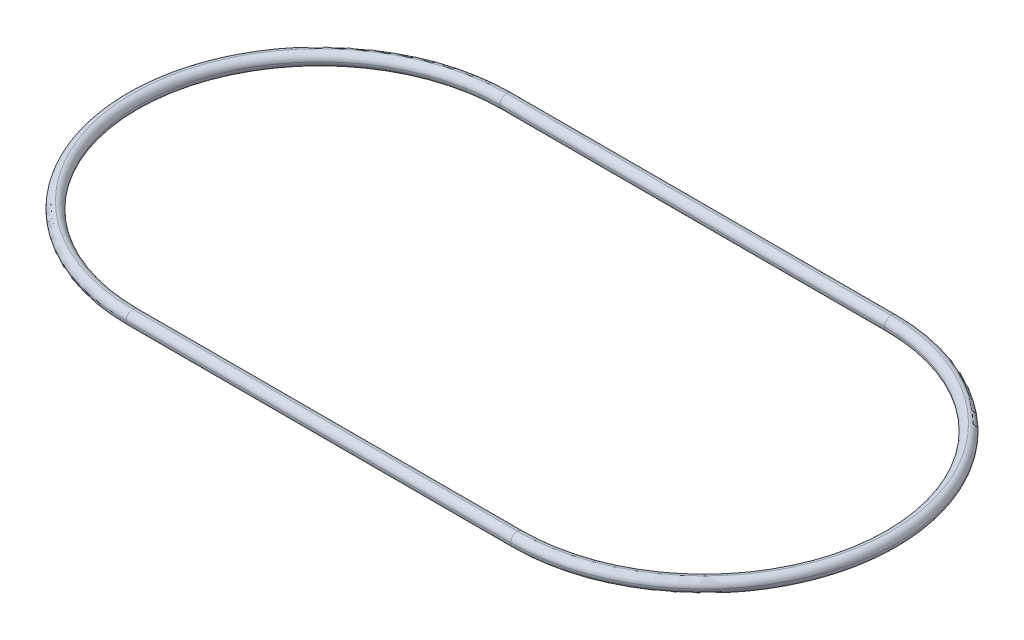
ISO-10303-21;
HEADER;
FILE_DESCRIPTION(('STEP AP214'),'2;1');
FILE_NAME('part.step','',(''),(''),'','','');
FILE_SCHEMA(('AUTOMOTIVE_DESIGN { 1 0 10303 214 1 1 1 1 }'));
ENDSEC;
DATA;
#1=APPLICATION_CONTEXT('core data for automotive mechanical design processes');
#2=APPLICATION_PROTOCOL_DEFINITION('international standard','automotive_design',2000,#1);
#3=PRODUCT_CONTEXT('',#1,'mechanical');
#4=PRODUCT('Part','Part','',(#3));
#5=PRODUCT_RELATED_PRODUCT_CATEGORY('part','',(#4));
#6=PRODUCT_DEFINITION_FORMATION('','',#4);
#7=PRODUCT_DEFINITION_CONTEXT('part definition',#1,'design');
#8=PRODUCT_DEFINITION('design','',#6,#7);
#9=PRODUCT_DEFINITION_SHAPE('','',#8);
#10=(LENGTH_UNIT() NAMED_UNIT(*) SI_UNIT(.MILLI.,.METRE.));
#11=(NAMED_UNIT(*) PLANE_ANGLE_UNIT() SI_UNIT($,.RADIAN.));
#12=(NAMED_UNIT(*) SI_UNIT($,.STERADIAN.) SOLID_ANGLE_UNIT());
#13=UNCERTAINTY_MEASURE_WITH_UNIT(LENGTH_MEASURE(1.E-05),#10,'distance_accuracy_value','');
#14=(GEOMETRIC_REPRESENTATION_CONTEXT(3) GLOBAL_UNCERTAINTY_ASSIGNED_CONTEXT((#13)) GLOBAL_UNIT_ASSIGNED_CONTEXT((#10,
#11,#12)) REPRESENTATION_CONTEXT('',''));
#15=CARTESIAN_POINT('',(0.,0.,0.));
#16=DIRECTION('',(0.,0.,1.));
#17=DIRECTION('',(1.,0.,0.));
#18=AXIS2_PLACEMENT_3D('',#15,#16,#17);
#19=CARTESIAN_POINT('',(0.,2.5,70.));
#20=DIRECTION('',(-1.,0.,0.));
#21=DIRECTION('',(0.,0.,1.));
#22=AXIS2_PLACEMENT_3D('',#19,#20,#21);
#23=CYLINDRICAL_SURFACE('',#22,2.5);
#24=CARTESIAN_POINT('',(144.,2.5,70.));
#25=DIRECTION('',(1.,0.,0.));
#26=DIRECTION('',(0.,0.,-1.));
#27=AXIS2_PLACEMENT_3D('',#24,#25,#26);
#28=CIRCLE('',#27,2.5);
#29=CARTESIAN_POINT('',(144.,5.,70.));
#30=VERTEX_POINT('',#29);
#31=CARTESIAN_POINT('',(144.,2.5,72.5));
#32=VERTEX_POINT('',#31);
#33=EDGE_CURVE('E11',#30,#32,#28,.T.);
#34=ORIENTED_EDGE('',*,*,#33,.F.);
#35=DIRECTION('',(1.,0.,0.));
#36=VECTOR('',#35,1.);
#37=CARTESIAN_POINT('',(144.,5.,70.));
#38=LINE('',#37,#36);
#39=CARTESIAN_POINT('',(0.,5.,70.));
#40=VERTEX_POINT('',#39);
#41=EDGE_CURVE('E185',#40,#30,#38,.T.);
#42=ORIENTED_EDGE('',*,*,#41,.F.);
#43=CARTESIAN_POINT('',(0.,2.5,70.));
#44=DIRECTION('',(-1.,0.,0.));
#45=DIRECTION('',(0.,0.,1.));
#46=AXIS2_PLACEMENT_3D('',#43,#44,#45);
#47=CIRCLE('',#46,2.5);
#48=CARTESIAN_POINT('',(0.,2.5,72.5));
#49=VERTEX_POINT('',#48);
#50=EDGE_CURVE('E182',#49,#40,#47,.T.);
#51=ORIENTED_EDGE('',*,*,#50,.F.);
#52=DIRECTION('',(1.,0.,0.));
#53=VECTOR('',#52,1.);
#54=CARTESIAN_POINT('',(0.,2.5,72.5));
#55=LINE('',#54,#53);
#56=EDGE_CURVE('E34',#32,#49,#55,.F.);
#57=ORIENTED_EDGE('',*,*,#56,.F.);
#58=EDGE_LOOP('',(#34,#42,#51,#57));
#59=FACE_BOUND('',#58,.T.);
#60=ADVANCED_FACE('F27',(#59),#23,.T.);
#61=CARTESIAN_POINT('',(144.,2.5,0.));
#62=DIRECTION('',(0.,1.,0.));
#63=DIRECTION('',(0.,0.,1.));
#64=AXIS2_PLACEMENT_3D('',#61,#62,#63);
#65=TOROIDAL_SURFACE('',#64,70.,2.5);
#66=CARTESIAN_POINT('',(144.,5.,0.));
#67=DIRECTION('',(0.,1.,0.));
#68=DIRECTION('',(0.,0.,1.));
#69=AXIS2_PLACEMENT_3D('',#66,#67,#68);
#70=CIRCLE('',#69,70.);
#71=CARTESIAN_POINT('',(144.,5.,-70.));
#72=VERTEX_POINT('',#71);
#73=EDGE_CURVE('E180',#30,#72,#70,.T.);
#74=ORIENTED_EDGE('',*,*,#73,.F.);
#75=ORIENTED_EDGE('',*,*,#33,.T.);
#76=CARTESIAN_POINT('',(144.,2.5,0.));
#77=DIRECTION('',(0.,1.,0.));
#78=DIRECTION('',(0.,0.,1.));
#79=AXIS2_PLACEMENT_3D('',#76,#77,#78);
#80=CIRCLE('',#79,72.5);
#81=CARTESIAN_POINT('',(144.,2.5,-72.5));
#82=VERTEX_POINT('',#81);
#83=EDGE_CURVE('E172',#82,#32,#80,.F.);
#84=ORIENTED_EDGE('',*,*,#83,.F.);
#85=CARTESIAN_POINT('',(144.,2.5,-70.));
#86=DIRECTION('',(-1.,0.,0.));
#87=DIRECTION('',(0.,0.,1.));
#88=AXIS2_PLACEMENT_3D('',#85,#86,#87);
#89=CIRCLE('',#88,2.5);
#90=EDGE_CURVE('E169',#72,#82,#89,.T.);
#91=ORIENTED_EDGE('',*,*,#90,.F.);
#92=EDGE_LOOP('',(#74,#75,#84,#91));
#93=FACE_BOUND('',#92,.T.);
#94=ADVANCED_FACE('F217',(#93),#65,.T.);
#95=CARTESIAN_POINT('',(144.,2.5,70.));
#96=DIRECTION('',(1.,0.,0.));
#97=DIRECTION('',(0.,0.,-1.));
#98=AXIS2_PLACEMENT_3D('',#95,#96,#97);
#99=CYLINDRICAL_SURFACE('',#98,2.5);
#100=CARTESIAN_POINT('',(144.,2.5,70.));
#101=DIRECTION('',(1.,0.,0.));
#102=DIRECTION('',(0.,0.,-1.));
#103=AXIS2_PLACEMENT_3D('',#100,#101,#102);
#104=CIRCLE('',#103,2.5);
#105=CARTESIAN_POINT('',(144.,0.,70.));
#106=VERTEX_POINT('',#105);
#107=EDGE_CURVE('E175',#32,#106,#104,.T.);
#108=ORIENTED_EDGE('',*,*,#107,.F.);
#109=ORIENTED_EDGE('',*,*,#56,.T.);
#110=CARTESIAN_POINT('',(0.,2.5,70.));
#111=DIRECTION('',(-1.,0.,0.));
#112=DIRECTION('',(0.,0.,1.));
#113=AXIS2_PLACEMENT_3D('',#110,#111,#112);
#114=CIRCLE('',#113,2.5);
#115=CARTESIAN_POINT('',(0.,0.,70.));
#116=VERTEX_POINT('',#115);
#117=EDGE_CURVE('E164',#116,#49,#114,.T.);
#118=ORIENTED_EDGE('',*,*,#117,.F.);
#119=DIRECTION('',(1.,0.,0.));
#120=VECTOR('',#119,1.);
#121=CARTESIAN_POINT('',(0.,0.,70.));
#122=LINE('',#121,#120);
#123=EDGE_CURVE('E161',#106,#116,#122,.F.);
#124=ORIENTED_EDGE('',*,*,#123,.F.);
#125=EDGE_LOOP('',(#108,#109,#118,#124));
#126=FACE_BOUND('',#125,.T.);
#127=ADVANCED_FACE('F189',(#126),#99,.T.);
#128=CARTESIAN_POINT('',(0.,2.5,70.));
#129=DIRECTION('',(1.,0.,0.));
#130=DIRECTION('',(0.,0.,-1.));
#131=AXIS2_PLACEMENT_3D('',#128,#129,#130);
#132=CYLINDRICAL_SURFACE('',#131,2.5);
#133=CARTESIAN_POINT('',(0.,2.5,70.));
#134=DIRECTION('',(-1.,0.,0.));
#135=DIRECTION('',(0.,0.,1.));
#136=AXIS2_PLACEMENT_3D('',#133,#134,#135);
#137=CIRCLE('',#136,2.5);
#138=CARTESIAN_POINT('',(0.,2.5,67.5));
#139=VERTEX_POINT('',#138);
#140=EDGE_CURVE('E155',#40,#139,#137,.T.);
#141=ORIENTED_EDGE('',*,*,#140,.F.);
#142=ORIENTED_EDGE('',*,*,#41,.T.);
#143=CARTESIAN_POINT('',(144.,2.5,70.));
#144=DIRECTION('',(1.,0.,0.));
#145=DIRECTION('',(0.,0.,-1.));
#146=AXIS2_PLACEMENT_3D('',#143,#144,#145);
#147=CIRCLE('',#146,2.5);
#148=CARTESIAN_POINT('',(144.,2.5,67.5));
#149=VERTEX_POINT('',#148);
#150=EDGE_CURVE('E177',#149,#30,#147,.T.);
#151=ORIENTED_EDGE('',*,*,#150,.F.);
#152=DIRECTION('',(1.,0.,0.));
#153=VECTOR('',#152,1.);
#154=CARTESIAN_POINT('',(0.,2.5,67.5));
#155=LINE('',#154,#153);
#156=EDGE_CURVE('E158',#139,#149,#155,.T.);
#157=ORIENTED_EDGE('',*,*,#156,.F.);
#158=EDGE_LOOP('',(#141,#142,#151,#157));
#159=FACE_BOUND('',#158,.T.);
#160=ADVANCED_FACE('F215',(#159),#132,.T.);
#161=CARTESIAN_POINT('',(0.,2.5,0.));
#162=DIRECTION('',(0.,1.,0.));
#163=DIRECTION('',(0.,0.,1.));
#164=AXIS2_PLACEMENT_3D('',#161,#162,#163);
#165=TOROIDAL_SURFACE('',#164,70.,2.5);
#166=CARTESIAN_POINT('',(0.,2.5,0.));
#167=DIRECTION('',(0.,1.,0.));
#168=DIRECTION('',(0.,0.,1.));
#169=AXIS2_PLACEMENT_3D('',#166,#167,#168);
#170=CIRCLE('',#169,72.5);
#171=CARTESIAN_POINT('',(0.,2.5,-72.5));
#172=VERTEX_POINT('',#171);
#173=EDGE_CURVE('E95',#49,#172,#170,.F.);
#174=ORIENTED_EDGE('',*,*,#173,.F.);
#175=ORIENTED_EDGE('',*,*,#50,.T.);
#176=CARTESIAN_POINT('',(0.,5.,0.));
#177=DIRECTION('',(0.,1.,0.));
#178=DIRECTION('',(0.,0.,1.));
#179=AXIS2_PLACEMENT_3D('',#176,#177,#178);
#180=CIRCLE('',#179,70.);
#181=CARTESIAN_POINT('',(0.,5.,-70.));
#182=VERTEX_POINT('',#181);
#183=EDGE_CURVE('E152',#182,#40,#180,.T.);
#184=ORIENTED_EDGE('',*,*,#183,.F.);
#185=CARTESIAN_POINT('',(0.,2.5,-70.));
#186=DIRECTION('',(1.,0.,0.));
#187=DIRECTION('',(0.,1.,0.));
#188=AXIS2_PLACEMENT_3D('',#185,#186,#187);
#189=CIRCLE('',#188,2.5);
#190=EDGE_CURVE('E167',#172,#182,#189,.T.);
#191=ORIENTED_EDGE('',*,*,#190,.F.);
#192=EDGE_LOOP('',(#174,#175,#184,#191));
#193=FACE_BOUND('',#192,.T.);
#194=ADVANCED_FACE('F194',(#193),#165,.T.);
#195=CARTESIAN_POINT('',(144.,2.5,0.));
#196=DIRECTION('',(0.,1.,0.));
#197=DIRECTION('',(0.,0.,1.));
#198=AXIS2_PLACEMENT_3D('',#195,#196,#197);
#199=TOROIDAL_SURFACE('',#198,70.,2.5);
#200=ORIENTED_EDGE('',*,*,#150,.T.);
#201=ORIENTED_EDGE('',*,*,#73,.T.);
#202=CARTESIAN_POINT('',(144.,2.5,-70.));
#203=DIRECTION('',(-1.,0.,0.));
#204=DIRECTION('',(0.,0.,1.));
#205=AXIS2_PLACEMENT_3D('',#202,#203,#204);
#206=CIRCLE('',#205,2.5);
#207=CARTESIAN_POINT('',(144.,2.5,-67.5));
#208=VERTEX_POINT('',#207);
#209=EDGE_CURVE('E144',#208,#72,#206,.T.);
#210=ORIENTED_EDGE('',*,*,#209,.F.);
#211=CARTESIAN_POINT('',(144.,2.5,0.));
#212=DIRECTION('',(0.,1.,0.));
#213=DIRECTION('',(0.,0.,1.));
#214=AXIS2_PLACEMENT_3D('',#211,#212,#213);
#215=CIRCLE('',#214,67.5);
#216=EDGE_CURVE('E141',#149,#208,#215,.T.);
#217=ORIENTED_EDGE('',*,*,#216,.F.);
#218=EDGE_LOOP('',(#200,#201,#210,#217));
#219=FACE_BOUND('',#218,.T.);
#220=ADVANCED_FACE('F216',(#219),#199,.T.);
#221=CARTESIAN_POINT('',(144.,2.5,0.));
#222=DIRECTION('',(0.,1.,0.));
#223=DIRECTION('',(0.,0.,1.));
#224=AXIS2_PLACEMENT_3D('',#221,#222,#223);
#225=TOROIDAL_SURFACE('',#224,70.,2.5);
#226=ORIENTED_EDGE('',*,*,#83,.T.);
#227=ORIENTED_EDGE('',*,*,#107,.T.);
#228=CARTESIAN_POINT('',(144.,0.,0.));
#229=DIRECTION('',(0.,1.,0.));
#230=DIRECTION('',(0.,0.,1.));
#231=AXIS2_PLACEMENT_3D('',#228,#229,#230);
#232=CIRCLE('',#231,70.);
#233=CARTESIAN_POINT('',(144.,0.,-70.));
#234=VERTEX_POINT('',#233);
#235=EDGE_CURVE('E135',#234,#106,#232,.F.);
#236=ORIENTED_EDGE('',*,*,#235,.F.);
#237=CARTESIAN_POINT('',(144.,2.5,-70.));
#238=DIRECTION('',(-1.,0.,0.));
#239=DIRECTION('',(0.,0.,1.));
#240=AXIS2_PLACEMENT_3D('',#237,#238,#239);
#241=CIRCLE('',#240,2.5);
#242=EDGE_CURVE('E116',#82,#234,#241,.T.);
#243=ORIENTED_EDGE('',*,*,#242,.F.);
#244=EDGE_LOOP('',(#226,#227,#236,#243));
#245=FACE_BOUND('',#244,.T.);
#246=ADVANCED_FACE('F201',(#245),#225,.T.);
#247=CARTESIAN_POINT('',(0.,2.5,-70.));
#248=DIRECTION('',(1.,0.,0.));
#249=DIRECTION('',(0.,0.,-1.));
#250=AXIS2_PLACEMENT_3D('',#247,#248,#249);
#251=CYLINDRICAL_SURFACE('',#250,2.5);
#252=DIRECTION('',(-1.,0.,0.));
#253=VECTOR('',#252,1.);
#254=CARTESIAN_POINT('',(0.,5.,-70.));
#255=LINE('',#254,#253);
#256=EDGE_CURVE('E147',#72,#182,#255,.T.);
#257=ORIENTED_EDGE('',*,*,#256,.F.);
#258=ORIENTED_EDGE('',*,*,#90,.T.);
#259=DIRECTION('',(-1.,0.,0.));
#260=VECTOR('',#259,1.);
#261=CARTESIAN_POINT('',(144.,2.5,-72.5));
#262=LINE('',#261,#260);
#263=EDGE_CURVE('E100',#172,#82,#262,.F.);
#264=ORIENTED_EDGE('',*,*,#263,.F.);
#265=ORIENTED_EDGE('',*,*,#190,.T.);
#266=EDGE_LOOP('',(#257,#258,#264,#265));
#267=FACE_BOUND('',#266,.T.);
#268=ADVANCED_FACE('F198',(#267),#251,.T.);
#269=CARTESIAN_POINT('',(0.,2.5,0.));
#270=DIRECTION('',(0.,1.,0.));
#271=DIRECTION('',(0.,0.,1.));
#272=AXIS2_PLACEMENT_3D('',#269,#270,#271);
#273=TOROIDAL_SURFACE('',#272,70.,2.5);
#274=ORIENTED_EDGE('',*,*,#117,.T.);
#275=ORIENTED_EDGE('',*,*,#173,.T.);
#276=CARTESIAN_POINT('',(0.,2.5,-70.));
#277=DIRECTION('',(1.,0.,0.));
#278=DIRECTION('',(0.,0.,-1.));
#279=AXIS2_PLACEMENT_3D('',#276,#277,#278);
#280=CIRCLE('',#279,2.5);
#281=CARTESIAN_POINT('',(0.,0.,-70.));
#282=VERTEX_POINT('',#281);
#283=EDGE_CURVE('E88',#282,#172,#280,.T.);
#284=ORIENTED_EDGE('',*,*,#283,.F.);
#285=CARTESIAN_POINT('',(0.,0.,0.));
#286=DIRECTION('',(0.,1.,0.));
#287=DIRECTION('',(0.,0.,1.));
#288=AXIS2_PLACEMENT_3D('',#285,#286,#287);
#289=CIRCLE('',#288,70.);
#290=EDGE_CURVE('E92',#116,#282,#289,.F.);
#291=ORIENTED_EDGE('',*,*,#290,.F.);
#292=EDGE_LOOP('',(#274,#275,#284,#291));
#293=FACE_BOUND('',#292,.T.);
#294=ADVANCED_FACE('F91',(#293),#273,.T.);
#295=CARTESIAN_POINT('',(0.,2.5,70.));
#296=DIRECTION('',(-1.,0.,0.));
#297=DIRECTION('',(0.,0.,1.));
#298=AXIS2_PLACEMENT_3D('',#295,#296,#297);
#299=CYLINDRICAL_SURFACE('',#298,2.5);
#300=CARTESIAN_POINT('',(0.,2.5,70.));
#301=DIRECTION('',(-1.,0.,0.));
#302=DIRECTION('',(0.,0.,1.));
#303=AXIS2_PLACEMENT_3D('',#300,#301,#302);
#304=CIRCLE('',#303,2.5);
#305=EDGE_CURVE('E109',#139,#116,#304,.T.);
#306=ORIENTED_EDGE('',*,*,#305,.F.);
#307=ORIENTED_EDGE('',*,*,#156,.T.);
#308=CARTESIAN_POINT('',(144.,2.5,70.));
#309=DIRECTION('',(1.,0.,0.));
#310=DIRECTION('',(0.,0.,-1.));
#311=AXIS2_PLACEMENT_3D('',#308,#309,#310);
#312=CIRCLE('',#311,2.5);
#313=EDGE_CURVE('E138',#106,#149,#312,.T.);
#314=ORIENTED_EDGE('',*,*,#313,.F.);
#315=ORIENTED_EDGE('',*,*,#123,.T.);
#316=EDGE_LOOP('',(#306,#307,#314,#315));
#317=FACE_BOUND('',#316,.T.);
#318=ADVANCED_FACE('F214',(#317),#299,.T.);
#319=CARTESIAN_POINT('',(0.,2.5,0.));
#320=DIRECTION('',(0.,1.,0.));
#321=DIRECTION('',(0.,0.,1.));
#322=AXIS2_PLACEMENT_3D('',#319,#320,#321);
#323=TOROIDAL_SURFACE('',#322,70.,2.5);
#324=CARTESIAN_POINT('',(0.,2.5,-70.));
#325=DIRECTION('',(1.,0.,0.));
#326=DIRECTION('',(0.,0.,-1.));
#327=AXIS2_PLACEMENT_3D('',#324,#325,#326);
#328=CIRCLE('',#327,2.5);
#329=CARTESIAN_POINT('',(0.,2.5,-67.5));
#330=VERTEX_POINT('',#329);
#331=EDGE_CURVE('E150',#182,#330,#328,.T.);
#332=ORIENTED_EDGE('',*,*,#331,.F.);
#333=ORIENTED_EDGE('',*,*,#183,.T.);
#334=ORIENTED_EDGE('',*,*,#140,.T.);
#335=CARTESIAN_POINT('',(0.,2.5,0.));
#336=DIRECTION('',(0.,1.,0.));
#337=DIRECTION('',(0.,0.,1.));
#338=AXIS2_PLACEMENT_3D('',#335,#336,#337);
#339=CIRCLE('',#338,67.5);
#340=EDGE_CURVE('E130',#330,#139,#339,.T.);
#341=ORIENTED_EDGE('',*,*,#340,.F.);
#342=EDGE_LOOP('',(#332,#333,#334,#341));
#343=FACE_BOUND('',#342,.T.);
#344=ADVANCED_FACE('F211',(#343),#323,.T.);
#345=CARTESIAN_POINT('',(144.,2.5,-70.));
#346=DIRECTION('',(-1.,0.,0.));
#347=DIRECTION('',(0.,0.,1.));
#348=AXIS2_PLACEMENT_3D('',#345,#346,#347);
#349=CYLINDRICAL_SURFACE('',#348,2.5);
#350=ORIENTED_EDGE('',*,*,#256,.T.);
#351=ORIENTED_EDGE('',*,*,#331,.T.);
#352=DIRECTION('',(-1.,0.,0.));
#353=VECTOR('',#352,1.);
#354=CARTESIAN_POINT('',(144.,2.5,-67.5));
#355=LINE('',#354,#353);
#356=EDGE_CURVE('E125',#208,#330,#355,.T.);
#357=ORIENTED_EDGE('',*,*,#356,.F.);
#358=ORIENTED_EDGE('',*,*,#209,.T.);
#359=EDGE_LOOP('',(#350,#351,#357,#358));
#360=FACE_BOUND('',#359,.T.);
#361=ADVANCED_FACE('F208',(#360),#349,.T.);
#362=CARTESIAN_POINT('',(144.,2.5,0.));
#363=DIRECTION('',(0.,1.,0.));
#364=DIRECTION('',(0.,0.,1.));
#365=AXIS2_PLACEMENT_3D('',#362,#363,#364);
#366=TOROIDAL_SURFACE('',#365,70.,2.5);
#367=ORIENTED_EDGE('',*,*,#313,.T.);
#368=ORIENTED_EDGE('',*,*,#216,.T.);
#369=CARTESIAN_POINT('',(144.,2.5,-70.));
#370=DIRECTION('',(-1.,0.,0.));
#371=DIRECTION('',(0.,0.,1.));
#372=AXIS2_PLACEMENT_3D('',#369,#370,#371);
#373=CIRCLE('',#372,2.5);
#374=EDGE_CURVE('E120',#234,#208,#373,.T.);
#375=ORIENTED_EDGE('',*,*,#374,.F.);
#376=ORIENTED_EDGE('',*,*,#235,.T.);
#377=EDGE_LOOP('',(#367,#368,#375,#376));
#378=FACE_BOUND('',#377,.T.);
#379=ADVANCED_FACE('F203',(#378),#366,.T.);
#380=CARTESIAN_POINT('',(0.,2.5,-70.));
#381=DIRECTION('',(-1.,0.,0.));
#382=DIRECTION('',(0.,0.,1.));
#383=AXIS2_PLACEMENT_3D('',#380,#381,#382);
#384=CYLINDRICAL_SURFACE('',#383,2.5);
#385=ORIENTED_EDGE('',*,*,#263,.T.);
#386=ORIENTED_EDGE('',*,*,#242,.T.);
#387=DIRECTION('',(-1.,0.,0.));
#388=VECTOR('',#387,1.);
#389=CARTESIAN_POINT('',(0.,0.,-70.));
#390=LINE('',#389,#388);
#391=EDGE_CURVE('E113',#282,#234,#390,.F.);
#392=ORIENTED_EDGE('',*,*,#391,.F.);
#393=ORIENTED_EDGE('',*,*,#283,.T.);
#394=EDGE_LOOP('',(#385,#386,#392,#393));
#395=FACE_BOUND('',#394,.T.);
#396=ADVANCED_FACE('F114',(#395),#384,.T.);
#397=CARTESIAN_POINT('',(0.,2.5,0.));
#398=DIRECTION('',(0.,1.,0.));
#399=DIRECTION('',(0.,0.,1.));
#400=AXIS2_PLACEMENT_3D('',#397,#398,#399);
#401=TOROIDAL_SURFACE('',#400,70.,2.5);
#402=ORIENTED_EDGE('',*,*,#305,.T.);
#403=ORIENTED_EDGE('',*,*,#290,.T.);
#404=CARTESIAN_POINT('',(0.,2.5,-70.));
#405=DIRECTION('',(1.,0.,0.));
#406=DIRECTION('',(0.,0.,-1.));
#407=AXIS2_PLACEMENT_3D('',#404,#405,#406);
#408=CIRCLE('',#407,2.5);
#409=EDGE_CURVE('E107',#330,#282,#408,.T.);
#410=ORIENTED_EDGE('',*,*,#409,.F.);
#411=ORIENTED_EDGE('',*,*,#340,.T.);
#412=EDGE_LOOP('',(#402,#403,#410,#411));
#413=FACE_BOUND('',#412,.T.);
#414=ADVANCED_FACE('F104',(#413),#401,.T.);
#415=CARTESIAN_POINT('',(0.,2.5,-70.));
#416=DIRECTION('',(1.,0.,0.));
#417=DIRECTION('',(0.,0.,-1.));
#418=AXIS2_PLACEMENT_3D('',#415,#416,#417);
#419=CYLINDRICAL_SURFACE('',#418,2.5);
#420=ORIENTED_EDGE('',*,*,#374,.T.);
#421=ORIENTED_EDGE('',*,*,#356,.T.);
#422=ORIENTED_EDGE('',*,*,#409,.T.);
#423=ORIENTED_EDGE('',*,*,#391,.T.);
#424=EDGE_LOOP('',(#420,#421,#422,#423));
#425=FACE_BOUND('',#424,.T.);
#426=ADVANCED_FACE('F123',(#425),#419,.T.);
#427=CLOSED_SHELL('',(#60,#94,#127,#160,#194,#220,#246,#268,#294,#318,#344,#361,#379,#396,#414,#426));
#428=MANIFOLD_SOLID_BREP('B2',#427);
#429=ADVANCED_BREP_SHAPE_REPRESENTATION('',(#18,#428),#14);
#430=SHAPE_DEFINITION_REPRESENTATION(#9,#429);
ENDSEC;
END-ISO-10303-21;
